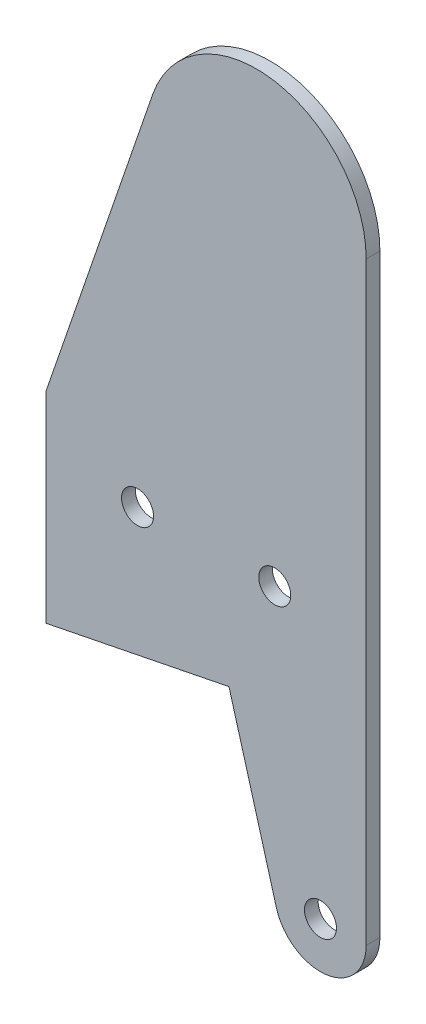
ISO-10303-21;
HEADER;
FILE_DESCRIPTION(('STEP AP214'),'2;1');
FILE_NAME('part.step','',(''),(''),'','','');
FILE_SCHEMA(('AUTOMOTIVE_DESIGN { 1 0 10303 214 1 1 1 1 }'));
ENDSEC;
DATA;
#1=APPLICATION_CONTEXT('core data for automotive mechanical design processes');
#2=APPLICATION_PROTOCOL_DEFINITION('international standard','automotive_design',2000,#1);
#3=PRODUCT_CONTEXT('',#1,'mechanical');
#4=PRODUCT('Part','Part','',(#3));
#5=PRODUCT_RELATED_PRODUCT_CATEGORY('part','',(#4));
#6=PRODUCT_DEFINITION_FORMATION('','',#4);
#7=PRODUCT_DEFINITION_CONTEXT('part definition',#1,'design');
#8=PRODUCT_DEFINITION('design','',#6,#7);
#9=PRODUCT_DEFINITION_SHAPE('','',#8);
#10=(LENGTH_UNIT() NAMED_UNIT(*) SI_UNIT(.MILLI.,.METRE.));
#11=(NAMED_UNIT(*) PLANE_ANGLE_UNIT() SI_UNIT($,.RADIAN.));
#12=(NAMED_UNIT(*) SI_UNIT($,.STERADIAN.) SOLID_ANGLE_UNIT());
#13=UNCERTAINTY_MEASURE_WITH_UNIT(LENGTH_MEASURE(1.E-05),#10,'distance_accuracy_value','');
#14=(GEOMETRIC_REPRESENTATION_CONTEXT(3) GLOBAL_UNCERTAINTY_ASSIGNED_CONTEXT((#13)) GLOBAL_UNIT_ASSIGNED_CONTEXT((#10,
#11,#12)) REPRESENTATION_CONTEXT('',''));
#15=CARTESIAN_POINT('',(0.,0.,0.));
#16=DIRECTION('',(0.,0.,1.));
#17=DIRECTION('',(1.,0.,0.));
#18=AXIS2_PLACEMENT_3D('',#15,#16,#17);
#19=CARTESIAN_POINT('',(0.,0.,1.5));
#20=DIRECTION('',(0.,0.,1.));
#21=DIRECTION('',(1.,0.,0.));
#22=AXIS2_PLACEMENT_3D('',#19,#20,#21);
#23=PLANE('',#22);
#24=CARTESIAN_POINT('',(-5.,29.,1.5));
#25=DIRECTION('',(0.,0.,1.));
#26=DIRECTION('',(1.,0.,0.));
#27=AXIS2_PLACEMENT_3D('',#24,#25,#26);
#28=CIRCLE('',#27,1.75);
#29=CARTESIAN_POINT('',(-3.25,29.,1.5));
#30=VERTEX_POINT('',#29);
#31=EDGE_CURVE('E221',#30,#30,#28,.T.);
#32=ORIENTED_EDGE('',*,*,#31,.F.);
#33=EDGE_LOOP('',(#32));
#34=FACE_BOUND('',#33,.T.);
#35=CARTESIAN_POINT('',(0.,0.,1.5));
#36=DIRECTION('',(0.,0.,1.));
#37=DIRECTION('',(1.,0.,0.));
#38=AXIS2_PLACEMENT_3D('',#35,#36,#37);
#39=CIRCLE('',#38,5.);
#40=CARTESIAN_POINT('',(-4.81155949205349,-1.35974087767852,1.5));
#41=VERTEX_POINT('',#40);
#42=CARTESIAN_POINT('',(5.,0.,1.5));
#43=VERTEX_POINT('',#42);
#44=EDGE_CURVE('E136',#41,#43,#39,.T.);
#45=ORIENTED_EDGE('',*,*,#44,.T.);
#46=DIRECTION('',(0.,1.,0.));
#47=VECTOR('',#46,1.);
#48=CARTESIAN_POINT('',(5.,0.,1.5));
#49=LINE('',#48,#47);
#50=CARTESIAN_POINT('',(5.,65.,1.5));
#51=VERTEX_POINT('',#50);
#52=EDGE_CURVE('E115',#43,#51,#49,.T.);
#53=ORIENTED_EDGE('',*,*,#52,.T.);
#54=CARTESIAN_POINT('',(-7.,65.,1.5));
#55=DIRECTION('',(0.,0.,1.));
#56=DIRECTION('',(1.,0.,0.));
#57=AXIS2_PLACEMENT_3D('',#54,#55,#56);
#58=CIRCLE('',#57,12.);
#59=CARTESIAN_POINT('',(-18.3484134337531,68.9004502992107,1.5));
#60=VERTEX_POINT('',#59);
#61=EDGE_CURVE('E139',#51,#60,#58,.T.);
#62=ORIENTED_EDGE('',*,*,#61,.T.);
#63=DIRECTION('',(-0.325037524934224,-0.945701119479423,0.));
#64=VECTOR('',#63,1.);
#65=CARTESIAN_POINT('',(-30.,35.,1.5));
#66=LINE('',#65,#64);
#67=CARTESIAN_POINT('',(-30.,35.,1.5));
#68=VERTEX_POINT('',#67);
#69=EDGE_CURVE('E141',#60,#68,#66,.T.);
#70=ORIENTED_EDGE('',*,*,#69,.T.);
#71=DIRECTION('',(0.,-1.,0.));
#72=VECTOR('',#71,1.);
#73=CARTESIAN_POINT('',(-30.,13.,1.5));
#74=LINE('',#73,#72);
#75=CARTESIAN_POINT('',(-30.,13.,1.5));
#76=VERTEX_POINT('',#75);
#77=EDGE_CURVE('E143',#68,#76,#74,.T.);
#78=ORIENTED_EDGE('',*,*,#77,.T.);
#79=DIRECTION('',(0.98058067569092,0.196116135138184,0.));
#80=VECTOR('',#79,1.);
#81=CARTESIAN_POINT('',(-30.,13.,1.5));
#82=LINE('',#81,#80);
#83=CARTESIAN_POINT('',(-10.,17.,1.5));
#84=VERTEX_POINT('',#83);
#85=EDGE_CURVE('E62',#76,#84,#82,.T.);
#86=ORIENTED_EDGE('',*,*,#85,.T.);
#87=DIRECTION('',(0.271948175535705,-0.962311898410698,0.));
#88=VECTOR('',#87,1.);
#89=CARTESIAN_POINT('',(-10.,17.,1.5));
#90=LINE('',#89,#88);
#91=EDGE_CURVE('E57',#84,#41,#90,.T.);
#92=ORIENTED_EDGE('',*,*,#91,.T.);
#93=EDGE_LOOP('',(#45,#53,#62,#70,#78,#86,#92));
#94=FACE_BOUND('',#93,.T.);
#95=CARTESIAN_POINT('',(0.,0.,1.5));
#96=DIRECTION('',(0.,0.,1.));
#97=DIRECTION('',(1.,0.,0.));
#98=AXIS2_PLACEMENT_3D('',#95,#96,#97);
#99=CIRCLE('',#98,1.75);
#100=CARTESIAN_POINT('',(1.75,0.,1.5));
#101=VERTEX_POINT('',#100);
#102=EDGE_CURVE('E120',#101,#101,#99,.T.);
#103=ORIENTED_EDGE('',*,*,#102,.F.);
#104=EDGE_LOOP('',(#103));
#105=FACE_BOUND('',#104,.T.);
#106=CARTESIAN_POINT('',(-20.,29.,1.5));
#107=DIRECTION('',(0.,0.,1.));
#108=DIRECTION('',(1.,0.,0.));
#109=AXIS2_PLACEMENT_3D('',#106,#107,#108);
#110=CIRCLE('',#109,1.75);
#111=CARTESIAN_POINT('',(-18.25,29.,1.5));
#112=VERTEX_POINT('',#111);
#113=EDGE_CURVE('E210',#112,#112,#110,.T.);
#114=ORIENTED_EDGE('',*,*,#113,.F.);
#115=EDGE_LOOP('',(#114));
#116=FACE_BOUND('',#115,.T.);
#117=ADVANCED_FACE('F42',(#34,#94,#105,#116),#23,.T.);
#118=CARTESIAN_POINT('',(0.,0.,0.));
#119=DIRECTION('',(0.,0.,1.));
#120=DIRECTION('',(1.,0.,0.));
#121=AXIS2_PLACEMENT_3D('',#118,#119,#120);
#122=PLANE('',#121);
#123=CARTESIAN_POINT('',(-5.,29.,0.));
#124=DIRECTION('',(0.,0.,1.));
#125=DIRECTION('',(1.,0.,0.));
#126=AXIS2_PLACEMENT_3D('',#123,#124,#125);
#127=CIRCLE('',#126,1.75);
#128=CARTESIAN_POINT('',(-3.25,29.,0.));
#129=VERTEX_POINT('',#128);
#130=EDGE_CURVE('E216',#129,#129,#127,.T.);
#131=ORIENTED_EDGE('',*,*,#130,.T.);
#132=EDGE_LOOP('',(#131));
#133=FACE_BOUND('',#132,.T.);
#134=CARTESIAN_POINT('',(0.,0.,0.));
#135=DIRECTION('',(0.,0.,1.));
#136=DIRECTION('',(1.,0.,0.));
#137=AXIS2_PLACEMENT_3D('',#134,#135,#136);
#138=CIRCLE('',#137,5.);
#139=CARTESIAN_POINT('',(-4.81155949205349,-1.35974087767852,0.));
#140=VERTEX_POINT('',#139);
#141=CARTESIAN_POINT('',(5.,0.,0.));
#142=VERTEX_POINT('',#141);
#143=EDGE_CURVE('E106',#140,#142,#138,.T.);
#144=ORIENTED_EDGE('',*,*,#143,.F.);
#145=DIRECTION('',(0.271948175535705,-0.962311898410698,0.));
#146=VECTOR('',#145,1.);
#147=CARTESIAN_POINT('',(-10.,17.,0.));
#148=LINE('',#147,#146);
#149=CARTESIAN_POINT('',(-10.,17.,0.));
#150=VERTEX_POINT('',#149);
#151=EDGE_CURVE('E134',#150,#140,#148,.T.);
#152=ORIENTED_EDGE('',*,*,#151,.F.);
#153=DIRECTION('',(0.98058067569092,0.196116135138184,0.));
#154=VECTOR('',#153,1.);
#155=CARTESIAN_POINT('',(-30.,13.,0.));
#156=LINE('',#155,#154);
#157=CARTESIAN_POINT('',(-30.,13.,0.));
#158=VERTEX_POINT('',#157);
#159=EDGE_CURVE('E132',#158,#150,#156,.T.);
#160=ORIENTED_EDGE('',*,*,#159,.F.);
#161=DIRECTION('',(0.,-1.,0.));
#162=VECTOR('',#161,1.);
#163=CARTESIAN_POINT('',(-30.,13.,0.));
#164=LINE('',#163,#162);
#165=CARTESIAN_POINT('',(-30.,35.,0.));
#166=VERTEX_POINT('',#165);
#167=EDGE_CURVE('E130',#166,#158,#164,.T.);
#168=ORIENTED_EDGE('',*,*,#167,.F.);
#169=DIRECTION('',(-0.325037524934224,-0.945701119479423,0.));
#170=VECTOR('',#169,1.);
#171=CARTESIAN_POINT('',(-30.,35.,0.));
#172=LINE('',#171,#170);
#173=CARTESIAN_POINT('',(-18.3484134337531,68.9004502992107,0.));
#174=VERTEX_POINT('',#173);
#175=EDGE_CURVE('E128',#174,#166,#172,.T.);
#176=ORIENTED_EDGE('',*,*,#175,.F.);
#177=CARTESIAN_POINT('',(-7.,65.,0.));
#178=DIRECTION('',(0.,0.,1.));
#179=DIRECTION('',(1.,0.,0.));
#180=AXIS2_PLACEMENT_3D('',#177,#178,#179);
#181=CIRCLE('',#180,12.);
#182=CARTESIAN_POINT('',(5.,65.,0.));
#183=VERTEX_POINT('',#182);
#184=EDGE_CURVE('E108',#183,#174,#181,.T.);
#185=ORIENTED_EDGE('',*,*,#184,.F.);
#186=DIRECTION('',(0.,1.,0.));
#187=VECTOR('',#186,1.);
#188=CARTESIAN_POINT('',(5.,0.,0.));
#189=LINE('',#188,#187);
#190=EDGE_CURVE('E101',#142,#183,#189,.T.);
#191=ORIENTED_EDGE('',*,*,#190,.F.);
#192=EDGE_LOOP('',(#144,#152,#160,#168,#176,#185,#191));
#193=FACE_BOUND('',#192,.T.);
#194=CARTESIAN_POINT('',(0.,0.,0.));
#195=DIRECTION('',(0.,0.,1.));
#196=DIRECTION('',(1.,0.,0.));
#197=AXIS2_PLACEMENT_3D('',#194,#195,#196);
#198=CIRCLE('',#197,1.75);
#199=CARTESIAN_POINT('',(1.75,0.,0.));
#200=VERTEX_POINT('',#199);
#201=EDGE_CURVE('E123',#200,#200,#198,.T.);
#202=ORIENTED_EDGE('',*,*,#201,.T.);
#203=EDGE_LOOP('',(#202));
#204=FACE_BOUND('',#203,.T.);
#205=CARTESIAN_POINT('',(-20.,29.,0.));
#206=DIRECTION('',(0.,0.,1.));
#207=DIRECTION('',(1.,0.,0.));
#208=AXIS2_PLACEMENT_3D('',#205,#206,#207);
#209=CIRCLE('',#208,1.75);
#210=CARTESIAN_POINT('',(-18.25,29.,0.));
#211=VERTEX_POINT('',#210);
#212=EDGE_CURVE('E213',#211,#211,#209,.T.);
#213=ORIENTED_EDGE('',*,*,#212,.T.);
#214=EDGE_LOOP('',(#213));
#215=FACE_BOUND('',#214,.T.);
#216=ADVANCED_FACE('F102',(#133,#193,#204,#215),#122,.F.);
#217=CARTESIAN_POINT('',(0.,0.,1.5));
#218=DIRECTION('',(0.,0.,-1.));
#219=DIRECTION('',(-1.,0.,0.));
#220=AXIS2_PLACEMENT_3D('',#217,#218,#219);
#221=CYLINDRICAL_SURFACE('',#220,5.);
#222=ORIENTED_EDGE('',*,*,#143,.T.);
#223=DIRECTION('',(0.,0.,-1.));
#224=VECTOR('',#223,1.);
#225=CARTESIAN_POINT('',(5.,0.,1.5));
#226=LINE('',#225,#224);
#227=EDGE_CURVE('E13',#43,#142,#226,.T.);
#228=ORIENTED_EDGE('',*,*,#227,.F.);
#229=ORIENTED_EDGE('',*,*,#44,.F.);
#230=DIRECTION('',(0.,0.,-1.));
#231=VECTOR('',#230,1.);
#232=CARTESIAN_POINT('',(-4.81155949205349,-1.35974087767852,1.5));
#233=LINE('',#232,#231);
#234=EDGE_CURVE('E119',#41,#140,#233,.T.);
#235=ORIENTED_EDGE('',*,*,#234,.T.);
#236=EDGE_LOOP('',(#222,#228,#229,#235));
#237=FACE_BOUND('',#236,.T.);
#238=ADVANCED_FACE('F44',(#237),#221,.T.);
#239=CARTESIAN_POINT('',(5.,0.,1.5));
#240=DIRECTION('',(-1.,0.,0.));
#241=DIRECTION('',(0.,0.,1.));
#242=AXIS2_PLACEMENT_3D('',#239,#240,#241);
#243=PLANE('',#242);
#244=ORIENTED_EDGE('',*,*,#190,.T.);
#245=DIRECTION('',(0.,0.,-1.));
#246=VECTOR('',#245,1.);
#247=CARTESIAN_POINT('',(5.,65.,1.5));
#248=LINE('',#247,#246);
#249=EDGE_CURVE('E50',#51,#183,#248,.T.);
#250=ORIENTED_EDGE('',*,*,#249,.F.);
#251=ORIENTED_EDGE('',*,*,#52,.F.);
#252=ORIENTED_EDGE('',*,*,#227,.T.);
#253=EDGE_LOOP('',(#244,#250,#251,#252));
#254=FACE_BOUND('',#253,.T.);
#255=ADVANCED_FACE('F114',(#254),#243,.F.);
#256=CARTESIAN_POINT('',(-7.,65.,1.5));
#257=DIRECTION('',(0.,0.,-1.));
#258=DIRECTION('',(-1.,0.,0.));
#259=AXIS2_PLACEMENT_3D('',#256,#257,#258);
#260=CYLINDRICAL_SURFACE('',#259,12.);
#261=ORIENTED_EDGE('',*,*,#184,.T.);
#262=DIRECTION('',(0.,0.,-1.));
#263=VECTOR('',#262,1.);
#264=CARTESIAN_POINT('',(-18.3484134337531,68.9004502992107,1.5));
#265=LINE('',#264,#263);
#266=EDGE_CURVE('E157',#60,#174,#265,.T.);
#267=ORIENTED_EDGE('',*,*,#266,.F.);
#268=ORIENTED_EDGE('',*,*,#61,.F.);
#269=ORIENTED_EDGE('',*,*,#249,.T.);
#270=EDGE_LOOP('',(#261,#267,#268,#269));
#271=FACE_BOUND('',#270,.T.);
#272=ADVANCED_FACE('F161',(#271),#260,.T.);
#273=CARTESIAN_POINT('',(-30.,35.,1.5));
#274=DIRECTION('',(0.945701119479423,-0.325037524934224,0.));
#275=DIRECTION('',(0.325037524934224,0.945701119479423,0.));
#276=AXIS2_PLACEMENT_3D('',#273,#274,#275);
#277=PLANE('',#276);
#278=ORIENTED_EDGE('',*,*,#175,.T.);
#279=DIRECTION('',(0.,0.,-1.));
#280=VECTOR('',#279,1.);
#281=CARTESIAN_POINT('',(-30.,35.,1.5));
#282=LINE('',#281,#280);
#283=EDGE_CURVE('E154',#68,#166,#282,.T.);
#284=ORIENTED_EDGE('',*,*,#283,.F.);
#285=ORIENTED_EDGE('',*,*,#69,.F.);
#286=ORIENTED_EDGE('',*,*,#266,.T.);
#287=EDGE_LOOP('',(#278,#284,#285,#286));
#288=FACE_BOUND('',#287,.T.);
#289=ADVANCED_FACE('F169',(#288),#277,.F.);
#290=CARTESIAN_POINT('',(-30.,13.,1.5));
#291=DIRECTION('',(1.,0.,0.));
#292=DIRECTION('',(0.,0.,-1.));
#293=AXIS2_PLACEMENT_3D('',#290,#291,#292);
#294=PLANE('',#293);
#295=ORIENTED_EDGE('',*,*,#167,.T.);
#296=DIRECTION('',(0.,0.,-1.));
#297=VECTOR('',#296,1.);
#298=CARTESIAN_POINT('',(-30.,13.,1.5));
#299=LINE('',#298,#297);
#300=EDGE_CURVE('E151',#76,#158,#299,.T.);
#301=ORIENTED_EDGE('',*,*,#300,.F.);
#302=ORIENTED_EDGE('',*,*,#77,.F.);
#303=ORIENTED_EDGE('',*,*,#283,.T.);
#304=EDGE_LOOP('',(#295,#301,#302,#303));
#305=FACE_BOUND('',#304,.T.);
#306=ADVANCED_FACE('F172',(#305),#294,.F.);
#307=CARTESIAN_POINT('',(-30.,13.,1.5));
#308=DIRECTION('',(-0.196116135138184,0.98058067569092,0.));
#309=DIRECTION('',(-0.98058067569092,-0.196116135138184,0.));
#310=AXIS2_PLACEMENT_3D('',#307,#308,#309);
#311=PLANE('',#310);
#312=ORIENTED_EDGE('',*,*,#159,.T.);
#313=DIRECTION('',(0.,0.,-1.));
#314=VECTOR('',#313,1.);
#315=CARTESIAN_POINT('',(-10.,17.,1.5));
#316=LINE('',#315,#314);
#317=EDGE_CURVE('E148',#84,#150,#316,.T.);
#318=ORIENTED_EDGE('',*,*,#317,.F.);
#319=ORIENTED_EDGE('',*,*,#85,.F.);
#320=ORIENTED_EDGE('',*,*,#300,.T.);
#321=EDGE_LOOP('',(#312,#318,#319,#320));
#322=FACE_BOUND('',#321,.T.);
#323=ADVANCED_FACE('F175',(#322),#311,.F.);
#324=CARTESIAN_POINT('',(-10.,17.,1.5));
#325=DIRECTION('',(0.962311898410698,0.271948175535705,0.));
#326=DIRECTION('',(-0.271948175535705,0.962311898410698,0.));
#327=AXIS2_PLACEMENT_3D('',#324,#325,#326);
#328=PLANE('',#327);
#329=ORIENTED_EDGE('',*,*,#151,.T.);
#330=ORIENTED_EDGE('',*,*,#234,.F.);
#331=ORIENTED_EDGE('',*,*,#91,.F.);
#332=ORIENTED_EDGE('',*,*,#317,.T.);
#333=EDGE_LOOP('',(#329,#330,#331,#332));
#334=FACE_BOUND('',#333,.T.);
#335=ADVANCED_FACE('F177',(#334),#328,.F.);
#336=CARTESIAN_POINT('',(0.,0.,1.5));
#337=DIRECTION('',(0.,0.,-1.));
#338=DIRECTION('',(-1.,0.,0.));
#339=AXIS2_PLACEMENT_3D('',#336,#337,#338);
#340=CYLINDRICAL_SURFACE('',#339,1.75);
#341=ORIENTED_EDGE('',*,*,#102,.T.);
#342=EDGE_LOOP('',(#341));
#343=FACE_BOUND('',#342,.T.);
#344=ORIENTED_EDGE('',*,*,#201,.F.);
#345=EDGE_LOOP('',(#344));
#346=FACE_BOUND('',#345,.T.);
#347=ADVANCED_FACE('F179',(#343,#346),#340,.F.);
#348=CARTESIAN_POINT('',(-5.,29.,1.5));
#349=DIRECTION('',(0.,0.,-1.));
#350=DIRECTION('',(-1.,0.,0.));
#351=AXIS2_PLACEMENT_3D('',#348,#349,#350);
#352=CYLINDRICAL_SURFACE('',#351,1.75);
#353=ORIENTED_EDGE('',*,*,#31,.T.);
#354=EDGE_LOOP('',(#353));
#355=FACE_BOUND('',#354,.T.);
#356=ORIENTED_EDGE('',*,*,#130,.F.);
#357=EDGE_LOOP('',(#356));
#358=FACE_BOUND('',#357,.T.);
#359=ADVANCED_FACE('F185',(#355,#358),#352,.F.);
#360=CARTESIAN_POINT('',(-20.,29.,1.5));
#361=DIRECTION('',(0.,0.,-1.));
#362=DIRECTION('',(-1.,0.,0.));
#363=AXIS2_PLACEMENT_3D('',#360,#361,#362);
#364=CYLINDRICAL_SURFACE('',#363,1.75);
#365=ORIENTED_EDGE('',*,*,#113,.T.);
#366=EDGE_LOOP('',(#365));
#367=FACE_BOUND('',#366,.T.);
#368=ORIENTED_EDGE('',*,*,#212,.F.);
#369=EDGE_LOOP('',(#368));
#370=FACE_BOUND('',#369,.T.);
#371=ADVANCED_FACE('F201',(#367,#370),#364,.F.);
#372=CLOSED_SHELL('',(#117,#216,#238,#255,#272,#289,#306,#323,#335,#347,#359,#371));
#373=MANIFOLD_SOLID_BREP('B2',#372);
#374=ADVANCED_BREP_SHAPE_REPRESENTATION('',(#18,#373),#14);
#375=SHAPE_DEFINITION_REPRESENTATION(#9,#374);
ENDSEC;
END-ISO-10303-21;
